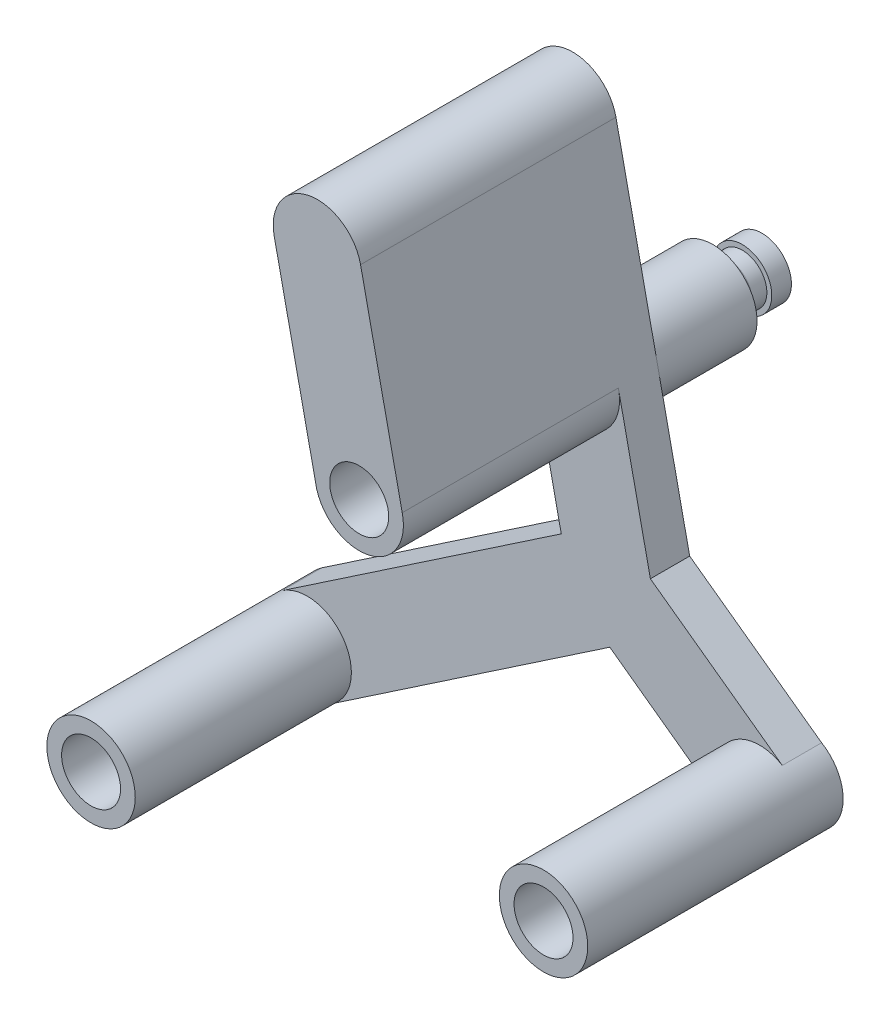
from build123d import *

# Parameters (mm, degrees)
SKETCH1_R             = 4.5
BOSS_EXTRUDE1_DEPTH   = 22
BOSS_EXTRUDE1_2_DEPTH = 22
BOSS_EXTRUDE1_3_DEPTH = 22
BOSS_EXTRUDE2_START   = -4
BOSS_EXTRUDE2_DEPTH   = 4
SKETCH3_R             = 2.5
BOSS_EXTRUDE3_DEPTH   = 10
BOSS_EXTRUDE5_DEPTH   = 26
SKETCH2_R             = 3
CUT_EXTRUDE1_DEPTH    = 8
SKETCH6_R             = 2.5
BOSS_EXTRUDE6_DEPTH   = 3
SKETCH7_R             = 3
BOSS_EXTRUDE7_DEPTH   = 2
FILLET2_R             = 1.5


with BuildPart() as part:
    # Sketch1 → Boss-Extrude1 (new body)
    with BuildSketch(Plane.XY):
        with Locations((-3.598485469, 16.757036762)):
            Circle(SKETCH1_R)
    extrude(amount=BOSS_EXTRUDE1_DEPTH)



with BuildPart() as body_2:
    # Sketch1 → Boss-Extrude1 2 (new body)
    with BuildSketch(Plane.XY):
        with Locations((15.163695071, -10.995991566)):
            Circle(SKETCH1_R)
    extrude(amount=BOSS_EXTRUDE1_2_DEPTH)


with BuildPart() as body_3:
    # Sketch1 → Boss-Extrude1 3 (new body)
    with BuildSketch(Plane.XY):
        with Locations((-30.896240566, -20.887120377)):
            Circle(SKETCH1_R)
    extrude(amount=BOSS_EXTRUDE1_3_DEPTH)


with BuildPart() as part_1:
    add(part.part)

    add(body_2.part)  # Boss-Extrude2 merges body 2

    add(body_3.part)  # Boss-Extrude2 merges body 3
    # Sketch1_4 → Boss-Extrude2 (add)
    with BuildSketch(Plane.XY.offset(BOSS_EXTRUDE2_START)):
        with BuildLine():
            Line((-5.028922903, 2.032082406), (-33.416533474, -17.159101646))
            ThreePointArc((-33.416533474, -17.159101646), (-34.624259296, -23.407413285), (-28.375947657, -24.615139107))
            Line((-28.375947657, -24.615139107), (-0.090488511, -5.493013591))
            Line((-0.090488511, -5.493013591), (12.521976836, -14.638974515))
            ThreePointArc((12.521976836, -14.638974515), (14.239388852, -15.400041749), (16.117868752, -15.393667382))
            ThreePointArc((16.117868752, -15.393667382), (18.80667802, -13.637709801), (19.640159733, -10.536356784))
            ThreePointArc((19.640159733, -10.536356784), (18.959463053, -8.57893852), (17.473719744, -7.134154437))
            Line((17.473719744, -7.134154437), (4.041883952, 2.605975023))
            Line((4.041883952, 2.605975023), (0.779643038, 17.797224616))
            ThreePointArc((0.779643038, 17.797224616), (-4.445502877, 21.176602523), (-8.050969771, 16.104822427))
            Line((-8.050969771, 16.104822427), (-5.028922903, 2.032082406))
        make_face()
    extrude(amount=BOSS_EXTRUDE2_DEPTH)

    # Sketch3 → Boss-Extrude3 (add)
    # profile 1 of 2: a face of its own
    with BuildSketch(Plane(origin=(0, 0, -4), x_dir=(-1, 0, 0), z_dir=(0, 0, -1))):
        with BuildLine():
            ThreePointArc((8.047495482, 16.088643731), (8.084923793, 16.421909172), (8.097423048, 16.757036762))
            ThreePointArc((8.097423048, 16.757036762), (-0.858314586, 17.371343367), (7.929662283, 15.539930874))
            Line((7.929662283, 15.539930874), (8.047495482, 16.088643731))
        make_face()
        with Locations((3.598485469, 16.757036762)):
            Circle(SKETCH3_R, mode=Mode.SUBTRACT)
    # profile 2 of 2: a face of its own
    with BuildSketch(Plane(origin=(0, 0, -4), x_dir=(-1, 0, 0), z_dir=(0, 0, -1))):
        with Locations((3.598485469, 16.757036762)):
            Circle(SKETCH3_R)
    extrude(amount=BOSS_EXTRUDE3_DEPTH)

    # Sketch5 → Boss-Extrude5 (add)
    with BuildSketch(Plane(origin=(0, 0, -4), x_dir=(-1, 0, 0), z_dir=(0, 0, -1))):
        with BuildLine():
            Line((8.050969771, 16.104822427), (12.250132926, 35.659029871))
            ThreePointArc((12.250132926, 35.659029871), (8.799426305, 40.997074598), (3.461381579, 37.546367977))
            Line((3.461381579, 37.546367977), (-0.779643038, 17.797224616))
            Line((-0.779643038, 17.797224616), (8.050969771, 16.104822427))
        make_face()
    extrude(amount=-BOSS_EXTRUDE5_DEPTH)

    # Sketch2 → Cut-Extrude1 (cut)
    with BuildSketch(Plane.XY.offset(22)):
        with Locations((-30.896240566, -20.887120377)):
            Circle(SKETCH2_R)
        with Locations((-3.598485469, 16.757036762)):
            Circle(SKETCH2_R)
        with Locations((15.163695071, -10.995991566)):
            Circle(SKETCH2_R)
    extrude(amount=-CUT_EXTRUDE1_DEPTH, mode=Mode.SUBTRACT)

    # Sketch6 → Boss-Extrude6 (add)
    with BuildSketch(Plane(origin=(0, 0, -14), x_dir=(-1, 0, 0), z_dir=(0, 0, -1))):
        with Locations((3.598485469, 16.757036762)):
            Circle(SKETCH6_R)
    extrude(amount=BOSS_EXTRUDE6_DEPTH)

    # Sketch7 → Boss-Extrude7 (add)
    with BuildSketch(Plane(origin=(0, 0, -17), x_dir=(-1, 0, 0), z_dir=(0, 0, -1))):
        with Locations(Location((3.598485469, 16.757036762, 0), (0, 0, 180))):
            Circle(SKETCH7_R)
    extrude(amount=BOSS_EXTRUDE7_DEPTH)

    # Fillet2
    fillet2_edges = [part_1.edges().sort_by_distance(p)[0] for p in [
        (-1.098485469, 16.757036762, -14),
    ]]
    fillet(fillet2_edges, radius=FILLET2_R)


solid = part_1.part
